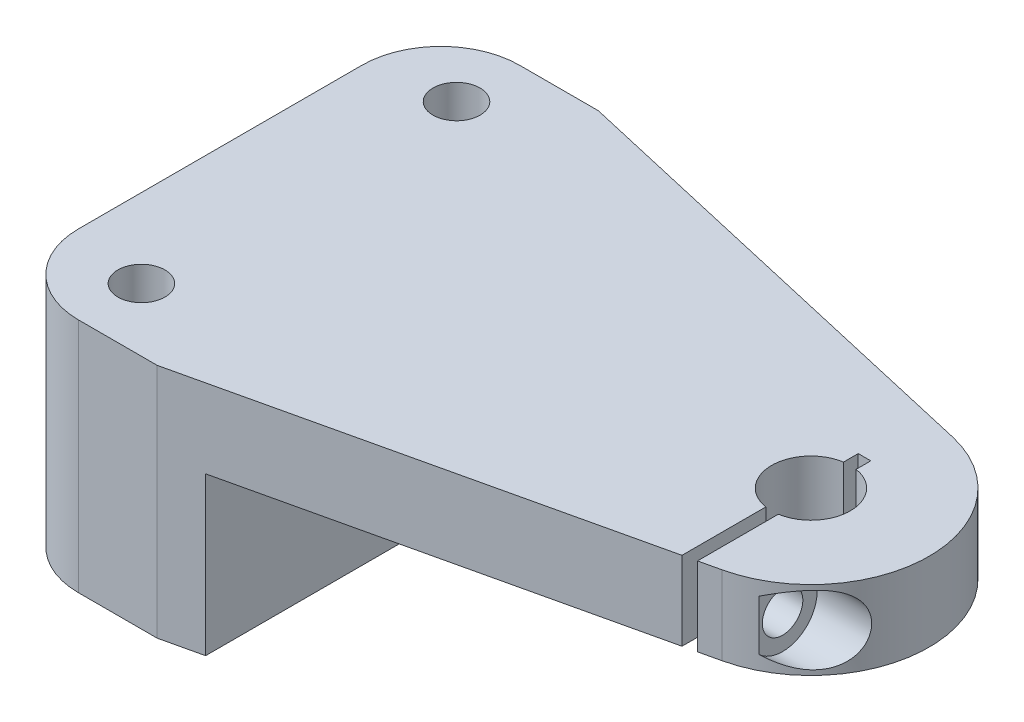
from build123d import *

# Parameters (mm, degrees)
SKETCH1_R                                      = 3.175
EXTRUDE1_DEPTH                                 = 19.05
F_6_CLEARANCE_HOLE1_D                          = 3.7973
CUT_EXTRUDE1_DEPTH                             = 56.076715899
CUT_EXTRUDE1_DEPTH_BACK                        = 56.076715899
SKETCH4_W                                      = 63.455944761
SKETCH4_H                                      = 25.263781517
SKETCH5_W                                      = 1.016
SKETCH5_H                                      = 17.369868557
CUT_EXTRUDE2_DEPTH                             = 55.287857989
CBORE_FOR_4_SOCKET_HEAD_CAP_SCREW1_D           = 3.2639
CBORE_FOR_4_SOCKET_HEAD_CAP_SCREW1_DEPTH       = 8.89
CBORE_FOR_4_SOCKET_HEAD_CAP_SCREW1_CBORE_D     = 5.55752
CBORE_FOR_4_SOCKET_HEAD_CAP_SCREW1_CBORE_DEPTH = 5.08
FILLET1_R                                      = 6.35


with BuildPart() as part:
    # Sketch1 → Extrude1 (new body)
    with BuildSketch(Plane(origin=(0, 0, 0), x_dir=(1, 0, 0), z_dir=(0, 1, 0))):
        with BuildLine():
            Line((-34.925, 17.78), (2.128714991, 9.284083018))
            ThreePointArc((2.128714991, 9.284083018), (9.525, 0), (2.128714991, -9.284083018))
            Line((2.128714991, -9.284083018), (-34.925, -17.78))
            Line((-34.925, -17.78), (-47.625, -17.78))
            Line((-47.625, -17.78), (-47.625, 17.78))
            Line((-47.625, 17.78), (-34.925, 17.78))
        make_face()
        with Locations(Location((0, 0, 0), (0, 0, 90))):
            Circle(SKETCH1_R, mode=Mode.SUBTRACT)
    extrude(amount=EXTRUDE1_DEPTH)

    # 6 Clearance Hole1 (through all)
    with Locations(Plane(origin=(0, 19.05, 0), x_dir=(-1, 0, 0), z_dir=(0, 1, 0))):
        with Locations((41.275, -12.7), (41.275, 12.7)):
            Hole(F_6_CLEARANCE_HOLE1_D / 2)

    # Sketch4 → Cut-Extrude1 (cut, two sides: drawn at the far end of the back side and taken through both)
    with BuildSketch(Plane(origin=(0.897301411, 0, 0), x_dir=(1, 0, 0), z_dir=(0, 0, 1)).offset(-CUT_EXTRUDE1_DEPTH_BACK)):
        with Locations((-0.919329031, 0.068109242)):
            Rectangle(SKETCH4_W, SKETCH4_H)
    extrude(amount=CUT_EXTRUDE1_DEPTH + CUT_EXTRUDE1_DEPTH_BACK, mode=Mode.SUBTRACT)

    # Sketch5 → Cut-Extrude2 (cut, through all)
    with BuildSketch(Plane(origin=(0, 19.05, 0), x_dir=(-1, 0, 0), z_dir=(0, 1, 0))):
        with Locations((0, 4.366934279)):
            Rectangle(SKETCH5_W, SKETCH5_H)
    extrude(amount=-CUT_EXTRUDE2_DEPTH, mode=Mode.SUBTRACT)

    # Sketch6 → 4-40 Tapped Hole1 (revolve, cut)
    with BuildSketch(Plane(origin=(-0.508, 15.875, 6.604), x_dir=(0, 0, -1), z_dir=(0, 1, 0))):
        Polygon((0, 0), (0, 8.273752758), (1.1303, 7.5946), (1.1303, 0), align=None)
    revolve(axis=Axis((5.842, 15.875, 6.604), (-1, 0, 0)), mode=Mode.SUBTRACT)

    # CBORE for _4 Socket Head Cap Screw1
    with Locations(Plane(origin=(9.398, 0, 0), x_dir=(0, 0, 1), z_dir=(1, 0, 0))):
        with Locations((6.604, -15.875)):
            CounterBoreHole(CBORE_FOR_4_SOCKET_HEAD_CAP_SCREW1_D / 2, CBORE_FOR_4_SOCKET_HEAD_CAP_SCREW1_CBORE_D / 2, CBORE_FOR_4_SOCKET_HEAD_CAP_SCREW1_CBORE_DEPTH, depth=CBORE_FOR_4_SOCKET_HEAD_CAP_SCREW1_DEPTH)

    # Fillet1
    fillet1_edges = [part.edges().sort_by_distance(p)[0] for p in [
        (-47.625, 9.525, 17.78),
        (-47.625, 9.525, -17.78),
    ]]
    fillet(fillet1_edges, radius=FILLET1_R)


solid = part.part
